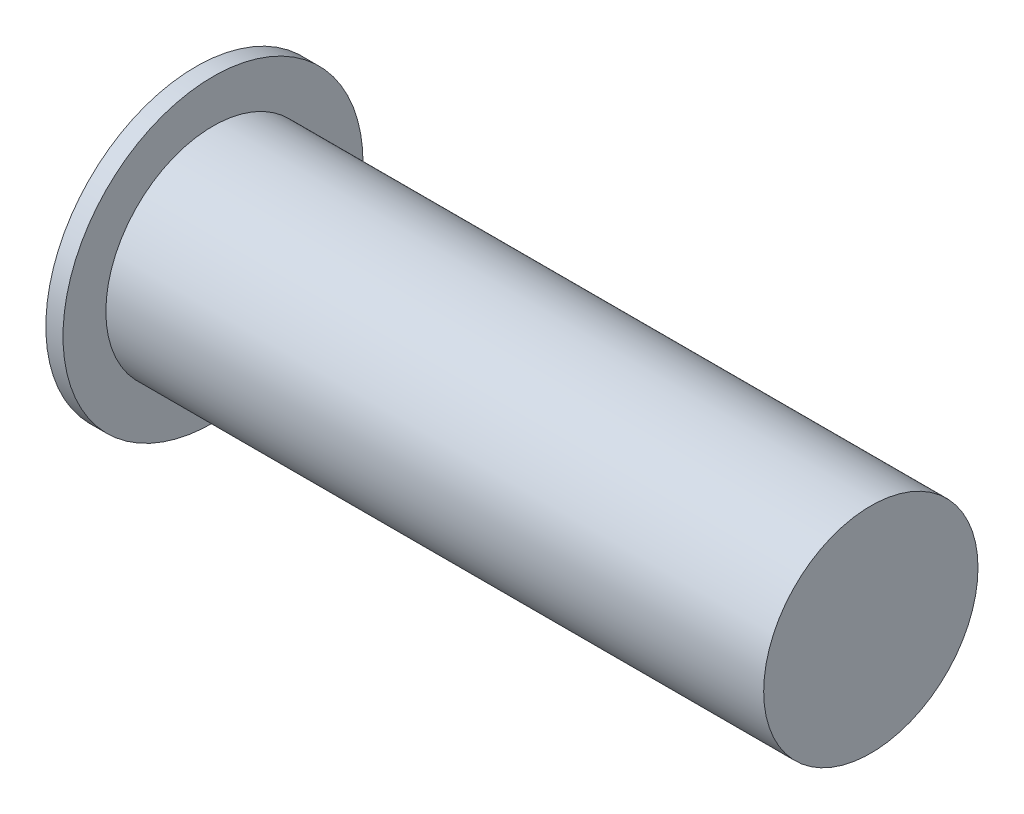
ISO-10303-21;
HEADER;
FILE_DESCRIPTION(('STEP AP214'),'2;1');
FILE_NAME('part.step','',(''),(''),'','','');
FILE_SCHEMA(('AUTOMOTIVE_DESIGN { 1 0 10303 214 1 1 1 1 }'));
ENDSEC;
DATA;
#1=APPLICATION_CONTEXT('core data for automotive mechanical design processes');
#2=APPLICATION_PROTOCOL_DEFINITION('international standard','automotive_design',2000,#1);
#3=PRODUCT_CONTEXT('',#1,'mechanical');
#4=PRODUCT('Part','Part','',(#3));
#5=PRODUCT_RELATED_PRODUCT_CATEGORY('part','',(#4));
#6=PRODUCT_DEFINITION_FORMATION('','',#4);
#7=PRODUCT_DEFINITION_CONTEXT('part definition',#1,'design');
#8=PRODUCT_DEFINITION('design','',#6,#7);
#9=PRODUCT_DEFINITION_SHAPE('','',#8);
#10=(LENGTH_UNIT() NAMED_UNIT(*) SI_UNIT(.MILLI.,.METRE.));
#11=(NAMED_UNIT(*) PLANE_ANGLE_UNIT() SI_UNIT($,.RADIAN.));
#12=(NAMED_UNIT(*) SI_UNIT($,.STERADIAN.) SOLID_ANGLE_UNIT());
#13=UNCERTAINTY_MEASURE_WITH_UNIT(LENGTH_MEASURE(1.E-05),#10,'distance_accuracy_value','');
#14=(GEOMETRIC_REPRESENTATION_CONTEXT(3) GLOBAL_UNCERTAINTY_ASSIGNED_CONTEXT((#13)) GLOBAL_UNIT_ASSIGNED_CONTEXT((#10,
#11,#12)) REPRESENTATION_CONTEXT('',''));
#15=CARTESIAN_POINT('',(0.,0.,0.));
#16=DIRECTION('',(0.,0.,1.));
#17=DIRECTION('',(1.,0.,0.));
#18=AXIS2_PLACEMENT_3D('',#15,#16,#17);
#19=CARTESIAN_POINT('',(0.,0.,0.));
#20=DIRECTION('',(-1.,0.,0.));
#21=DIRECTION('',(0.,0.,1.));
#22=AXIS2_PLACEMENT_3D('',#19,#20,#21);
#23=PLANE('',#22);
#24=CARTESIAN_POINT('',(0.,0.,-3.175));
#25=DIRECTION('',(1.,0.,0.));
#26=DIRECTION('',(0.,0.,-1.));
#27=AXIS2_PLACEMENT_3D('',#24,#25,#26);
#28=CIRCLE('',#27,3.175);
#29=CARTESIAN_POINT('',(0.,0.,-6.35));
#30=VERTEX_POINT('',#29);
#31=EDGE_CURVE('E109',#30,#30,#28,.T.);
#32=ORIENTED_EDGE('',*,*,#31,.T.);
#33=EDGE_LOOP('',(#32));
#34=FACE_BOUND('',#33,.T.);
#35=ADVANCED_FACE('F34',(#34),#23,.F.);
#36=CARTESIAN_POINT('',(-19.9980085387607,0.,1.27));
#37=DIRECTION('',(1.,0.,0.));
#38=DIRECTION('',(0.,0.,-1.));
#39=AXIS2_PLACEMENT_3D('',#36,#37,#38);
#40=PLANE('',#39);
#41=DIRECTION('',(0.,0.,1.));
#42=VECTOR('',#41,1.);
#43=CARTESIAN_POINT('',(-19.9980085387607,-0.378183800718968,0.));
#44=LINE('',#43,#42);
#45=CARTESIAN_POINT('',(-19.9980085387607,-0.378183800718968,-6.15375985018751));
#46=VERTEX_POINT('',#45);
#47=CARTESIAN_POINT('',(-19.9980085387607,-0.378183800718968,0.));
#48=VERTEX_POINT('',#47);
#49=EDGE_CURVE('E83',#46,#48,#44,.T.);
#50=ORIENTED_EDGE('',*,*,#49,.F.);
#51=DIRECTION('',(0.,-1.,0.));
#52=VECTOR('',#51,1.);
#53=CARTESIAN_POINT('',(-19.9980085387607,-0.378183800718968,-6.15375985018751));
#54=LINE('',#53,#52);
#55=CARTESIAN_POINT('',(-19.9980085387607,0.35268826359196,-6.15375985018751));
#56=VERTEX_POINT('',#55);
#57=EDGE_CURVE('E48',#56,#46,#54,.T.);
#58=ORIENTED_EDGE('',*,*,#57,.F.);
#59=DIRECTION('',(0.,0.,-1.));
#60=VECTOR('',#59,1.);
#61=CARTESIAN_POINT('',(-19.9980085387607,0.35268826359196,-6.15375985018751));
#62=LINE('',#61,#60);
#63=CARTESIAN_POINT('',(-19.9980085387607,0.35268826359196,0.));
#64=VERTEX_POINT('',#63);
#65=EDGE_CURVE('E99',#64,#56,#62,.T.);
#66=ORIENTED_EDGE('',*,*,#65,.F.);
#67=DIRECTION('',(0.,1.,0.));
#68=VECTOR('',#67,1.);
#69=CARTESIAN_POINT('',(-19.9980085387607,0.35268826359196,0.));
#70=LINE('',#69,#68);
#71=EDGE_CURVE('E105',#48,#64,#70,.T.);
#72=ORIENTED_EDGE('',*,*,#71,.F.);
#73=EDGE_LOOP('',(#50,#58,#66,#72));
#74=FACE_BOUND('',#73,.T.);
#75=CARTESIAN_POINT('',(-19.9980085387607,0.,-3.175));
#76=DIRECTION('',(1.,0.,0.));
#77=DIRECTION('',(0.,0.,-1.));
#78=AXIS2_PLACEMENT_3D('',#75,#76,#77);
#79=CIRCLE('',#78,4.445);
#80=CARTESIAN_POINT('',(-19.9980085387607,0.,-7.62));
#81=VERTEX_POINT('',#80);
#82=EDGE_CURVE('E11',#81,#81,#79,.T.);
#83=ORIENTED_EDGE('',*,*,#82,.F.);
#84=EDGE_LOOP('',(#83));
#85=FACE_BOUND('',#84,.T.);
#86=ADVANCED_FACE('F124',(#74,#85),#40,.F.);
#87=CARTESIAN_POINT('',(0.,0.,-3.175));
#88=DIRECTION('',(1.,0.,0.));
#89=DIRECTION('',(0.,0.,-1.));
#90=AXIS2_PLACEMENT_3D('',#87,#88,#89);
#91=CYLINDRICAL_SURFACE('',#90,4.445);
#92=CARTESIAN_POINT('',(-19.4900085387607,0.,-3.175));
#93=DIRECTION('',(1.,0.,0.));
#94=DIRECTION('',(0.,0.,-1.));
#95=AXIS2_PLACEMENT_3D('',#92,#93,#94);
#96=CIRCLE('',#95,4.445);
#97=CARTESIAN_POINT('',(-19.4900085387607,0.,-7.62));
#98=VERTEX_POINT('',#97);
#99=EDGE_CURVE('E41',#98,#98,#96,.T.);
#100=ORIENTED_EDGE('',*,*,#99,.F.);
#101=EDGE_LOOP('',(#100));
#102=FACE_BOUND('',#101,.T.);
#103=ORIENTED_EDGE('',*,*,#82,.T.);
#104=EDGE_LOOP('',(#103));
#105=FACE_BOUND('',#104,.T.);
#106=ADVANCED_FACE('F121',(#102,#105),#91,.T.);
#107=CARTESIAN_POINT('',(-19.4900085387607,0.,0.));
#108=DIRECTION('',(-1.,0.,0.));
#109=DIRECTION('',(0.,0.,1.));
#110=AXIS2_PLACEMENT_3D('',#107,#108,#109);
#111=PLANE('',#110);
#112=CARTESIAN_POINT('',(-19.4900085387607,0.,-3.175));
#113=DIRECTION('',(1.,0.,0.));
#114=DIRECTION('',(0.,0.,-1.));
#115=AXIS2_PLACEMENT_3D('',#112,#113,#114);
#116=CIRCLE('',#115,3.175);
#117=CARTESIAN_POINT('',(-19.4900085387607,0.,-6.35));
#118=VERTEX_POINT('',#117);
#119=EDGE_CURVE('E114',#118,#118,#116,.T.);
#120=ORIENTED_EDGE('',*,*,#119,.F.);
#121=EDGE_LOOP('',(#120));
#122=FACE_BOUND('',#121,.T.);
#123=ORIENTED_EDGE('',*,*,#99,.T.);
#124=EDGE_LOOP('',(#123));
#125=FACE_BOUND('',#124,.T.);
#126=ADVANCED_FACE('F119',(#122,#125),#111,.F.);
#127=CARTESIAN_POINT('',(0.,0.,-3.175));
#128=DIRECTION('',(1.,0.,0.));
#129=DIRECTION('',(0.,0.,-1.));
#130=AXIS2_PLACEMENT_3D('',#127,#128,#129);
#131=CYLINDRICAL_SURFACE('',#130,3.175);
#132=ORIENTED_EDGE('',*,*,#31,.F.);
#133=EDGE_LOOP('',(#132));
#134=FACE_BOUND('',#133,.T.);
#135=ORIENTED_EDGE('',*,*,#119,.T.);
#136=EDGE_LOOP('',(#135));
#137=FACE_BOUND('',#136,.T.);
#138=ADVANCED_FACE('F137',(#134,#137),#131,.T.);
#139=CARTESIAN_POINT('',(-19.7440085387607,-0.378183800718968,-6.15375985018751));
#140=DIRECTION('',(0.,0.,-1.));
#141=DIRECTION('',(-1.,0.,0.));
#142=AXIS2_PLACEMENT_3D('',#139,#140,#141);
#143=PLANE('',#142);
#144=ORIENTED_EDGE('',*,*,#57,.T.);
#145=DIRECTION('',(-1.,0.,0.));
#146=VECTOR('',#145,1.);
#147=CARTESIAN_POINT('',(-19.7440085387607,-0.378183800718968,-6.15375985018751));
#148=LINE('',#147,#146);
#149=CARTESIAN_POINT('',(-19.7440085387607,-0.378183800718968,-6.15375985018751));
#150=VERTEX_POINT('',#149);
#151=EDGE_CURVE('E71',#150,#46,#148,.T.);
#152=ORIENTED_EDGE('',*,*,#151,.F.);
#153=DIRECTION('',(0.,-1.,0.));
#154=VECTOR('',#153,1.);
#155=CARTESIAN_POINT('',(-19.7440085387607,-0.378183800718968,-6.15375985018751));
#156=LINE('',#155,#154);
#157=CARTESIAN_POINT('',(-19.7440085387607,0.35268826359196,-6.15375985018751));
#158=VERTEX_POINT('',#157);
#159=EDGE_CURVE('E97',#158,#150,#156,.T.);
#160=ORIENTED_EDGE('',*,*,#159,.F.);
#161=DIRECTION('',(-1.,0.,0.));
#162=VECTOR('',#161,1.);
#163=CARTESIAN_POINT('',(-19.7440085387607,0.35268826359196,-6.15375985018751));
#164=LINE('',#163,#162);
#165=EDGE_CURVE('E56',#158,#56,#164,.T.);
#166=ORIENTED_EDGE('',*,*,#165,.T.);
#167=EDGE_LOOP('',(#144,#152,#160,#166));
#168=FACE_BOUND('',#167,.T.);
#169=ADVANCED_FACE('F141',(#168),#143,.F.);
#170=CARTESIAN_POINT('',(-19.7440085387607,0.35268826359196,-6.15375985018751));
#171=DIRECTION('',(0.,1.,0.));
#172=DIRECTION('',(0.,0.,1.));
#173=AXIS2_PLACEMENT_3D('',#170,#171,#172);
#174=PLANE('',#173);
#175=ORIENTED_EDGE('',*,*,#65,.T.);
#176=ORIENTED_EDGE('',*,*,#165,.F.);
#177=DIRECTION('',(0.,0.,-1.));
#178=VECTOR('',#177,1.);
#179=CARTESIAN_POINT('',(-19.7440085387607,0.35268826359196,-6.15375985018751));
#180=LINE('',#179,#178);
#181=CARTESIAN_POINT('',(-19.7440085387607,0.35268826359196,0.));
#182=VERTEX_POINT('',#181);
#183=EDGE_CURVE('E94',#182,#158,#180,.T.);
#184=ORIENTED_EDGE('',*,*,#183,.F.);
#185=DIRECTION('',(-1.,0.,0.));
#186=VECTOR('',#185,1.);
#187=CARTESIAN_POINT('',(-19.7440085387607,0.35268826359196,0.));
#188=LINE('',#187,#186);
#189=EDGE_CURVE('E87',#182,#64,#188,.T.);
#190=ORIENTED_EDGE('',*,*,#189,.T.);
#191=EDGE_LOOP('',(#175,#176,#184,#190));
#192=FACE_BOUND('',#191,.T.);
#193=ADVANCED_FACE('F145',(#192),#174,.F.);
#194=CARTESIAN_POINT('',(-19.7440085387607,0.35268826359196,0.));
#195=DIRECTION('',(0.,0.,1.));
#196=DIRECTION('',(1.,0.,0.));
#197=AXIS2_PLACEMENT_3D('',#194,#195,#196);
#198=PLANE('',#197);
#199=ORIENTED_EDGE('',*,*,#71,.T.);
#200=ORIENTED_EDGE('',*,*,#189,.F.);
#201=DIRECTION('',(0.,1.,0.));
#202=VECTOR('',#201,1.);
#203=CARTESIAN_POINT('',(-19.7440085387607,0.35268826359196,0.));
#204=LINE('',#203,#202);
#205=CARTESIAN_POINT('',(-19.7440085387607,-0.378183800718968,0.));
#206=VERTEX_POINT('',#205);
#207=EDGE_CURVE('E90',#206,#182,#204,.T.);
#208=ORIENTED_EDGE('',*,*,#207,.F.);
#209=DIRECTION('',(-1.,0.,0.));
#210=VECTOR('',#209,1.);
#211=CARTESIAN_POINT('',(-19.7440085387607,-0.378183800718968,0.));
#212=LINE('',#211,#210);
#213=EDGE_CURVE('E76',#206,#48,#212,.T.);
#214=ORIENTED_EDGE('',*,*,#213,.T.);
#215=EDGE_LOOP('',(#199,#200,#208,#214));
#216=FACE_BOUND('',#215,.T.);
#217=ADVANCED_FACE('F91',(#216),#198,.F.);
#218=CARTESIAN_POINT('',(-19.7440085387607,-0.378183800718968,0.));
#219=DIRECTION('',(0.,-1.,0.));
#220=DIRECTION('',(0.,0.,-1.));
#221=AXIS2_PLACEMENT_3D('',#218,#219,#220);
#222=PLANE('',#221);
#223=ORIENTED_EDGE('',*,*,#49,.T.);
#224=ORIENTED_EDGE('',*,*,#213,.F.);
#225=DIRECTION('',(0.,0.,1.));
#226=VECTOR('',#225,1.);
#227=CARTESIAN_POINT('',(-19.7440085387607,-0.378183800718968,0.));
#228=LINE('',#227,#226);
#229=EDGE_CURVE('E80',#150,#206,#228,.T.);
#230=ORIENTED_EDGE('',*,*,#229,.F.);
#231=ORIENTED_EDGE('',*,*,#151,.T.);
#232=EDGE_LOOP('',(#223,#224,#230,#231));
#233=FACE_BOUND('',#232,.T.);
#234=ADVANCED_FACE('F78',(#233),#222,.F.);
#235=CARTESIAN_POINT('',(-19.7440085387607,0.,0.));
#236=DIRECTION('',(1.,0.,0.));
#237=DIRECTION('',(0.,0.,-1.));
#238=AXIS2_PLACEMENT_3D('',#235,#236,#237);
#239=PLANE('',#238);
#240=ORIENTED_EDGE('',*,*,#159,.T.);
#241=ORIENTED_EDGE('',*,*,#229,.T.);
#242=ORIENTED_EDGE('',*,*,#207,.T.);
#243=ORIENTED_EDGE('',*,*,#183,.T.);
#244=EDGE_LOOP('',(#240,#241,#242,#243));
#245=FACE_BOUND('',#244,.T.);
#246=ADVANCED_FACE('F96',(#245),#239,.F.);
#247=CLOSED_SHELL('',(#35,#86,#106,#126,#138,#169,#193,#217,#234,#246));
#248=MANIFOLD_SOLID_BREP('B2',#247);
#249=ADVANCED_BREP_SHAPE_REPRESENTATION('',(#18,#248),#14);
#250=SHAPE_DEFINITION_REPRESENTATION(#9,#249);
ENDSEC;
END-ISO-10303-21;
